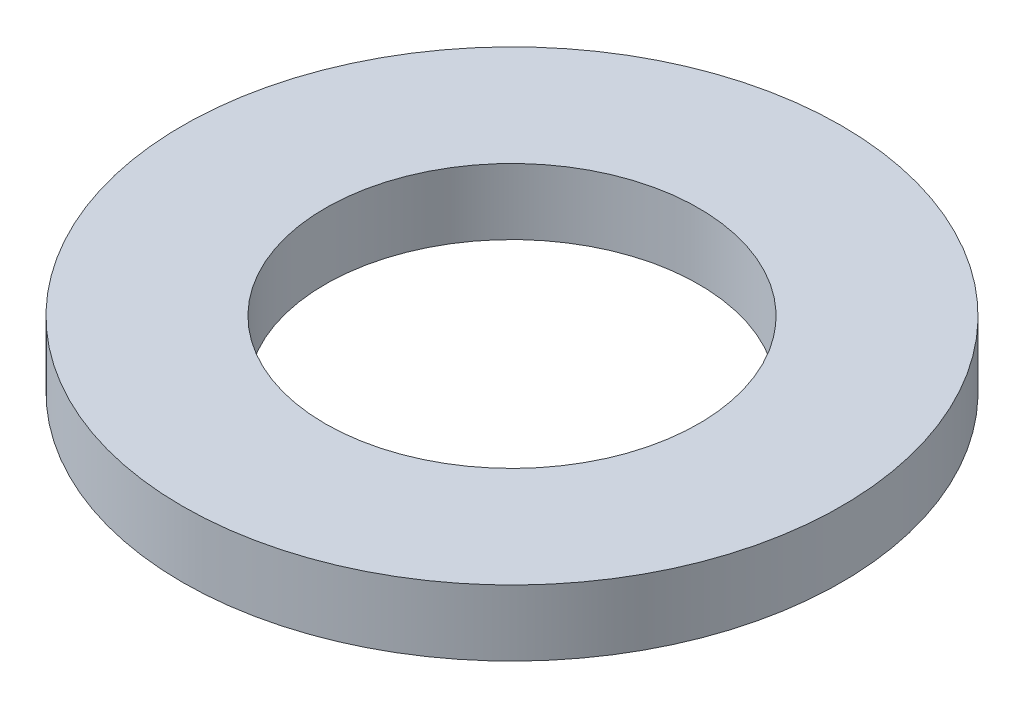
from build123d import *

# Parameters (mm, degrees)
ESQUISSE1_R      = 15
ESQUISSE1_R_2    = 8.5
EXTRUSION1_DEPTH = 3


with BuildPart() as part:
    # Esquisse1 → Extrusion1 (new body)
    with BuildSketch(Plane(origin=(0, 0, 0), x_dir=(1, 0, 0), z_dir=(0, 1, 0))):
        with Locations(Location((0, 0, 0), (0, 0, 270))):
            Circle(ESQUISSE1_R)
        with Locations(Location((0, 0, 0), (0, 0, 270))):
            Circle(ESQUISSE1_R_2, mode=Mode.SUBTRACT)
    extrude(amount=EXTRUSION1_DEPTH)


solid = part.part
